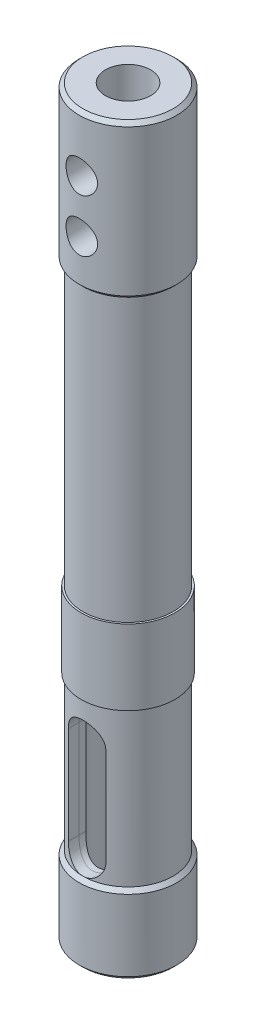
from build123d import *

# Parameters (mm, degrees)
ESQUISSE3_R                = 4.75
ESQUISSE3_R_2              = 4
BOSS_EXTRU_1_DEPTH         = 75
ESQUISSE4_W                = 2.1
ESQUISSE4_H                = 6.5
TROU_TARAUD_M51_AT_2_COUNT = 2
TROU_TARAUD_M51_AT_2_PITCH = 7
ENL_V_MAT_EXTRU_1_DEPTH    = 100.425851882
CHANFREIN1_SIZE            = 0.5


with BuildPart() as part:
    # Esquisse2 → R_volution1 (revolve)
    with BuildSketch(Plane.XY, mode=Mode.PRIVATE) as r_volution1_sk:
        Polygon((-4.75, 0), (-4.75, 75), (-3, 75), (-3, 99), (-6.5, 99), (-6.5, 79), (-6, 78.5), (-6, 41), (-6.25, 41), (-6.25, 31), (-6, 31), (-6, 10.5), (-6.5, 10), (-6.5, 0), align=None)
    revolve(r_volution1_sk.sketch.rotate(Axis((0, 0, 0), (0, 1, 0)), 270), axis=Axis((0, 0, 0), (0, 1, 0)))

    # Esquisse4 → Trou taraud_ M51 (revolve, cut)
    with BuildSketch(Plane(origin=(0, 91.5, 0), x_dir=(0, 1, 0), z_dir=(1, 0, 0))):
        with Locations((1.05, 3.25)):
            Rectangle(ESQUISSE4_W, ESQUISSE4_H)
    trou_taraud_m51 = revolve(axis=Axis((0, 91.5, -6.35), (0, 0, 1)), mode=Mode.SUBTRACT)

    # Trou taraud_ M51 at 2: Trou taraud_ M51 ×2
    with Locations(*[(0, -i * TROU_TARAUD_M51_AT_2_PITCH, 0) for i in range(1, TROU_TARAUD_M51_AT_2_COUNT)]):
        add(trou_taraud_m51, mode=Mode.SUBTRACT)


with BuildPart() as body_2:
    # Esquisse3 → Boss.-Extru.1 (new body)
    with BuildSketch(Plane.XZ):
        with Locations(Location((0, 0, 0), (0, 0, 270))):
            Circle(ESQUISSE3_R)
        with Locations(Location((0, 0, 0), (0, 0, 270))):
            Circle(ESQUISSE3_R_2, mode=Mode.SUBTRACT)
    extrude(amount=-BOSS_EXTRU_1_DEPTH)


with BuildPart() as enl_v_mat_extru_1_tool:
    # Esquisse6 → Enl_v. mat.-Extru.1 (new, through all)
    with BuildSketch(Plane.XY):
        with BuildLine():
            Line((2.5, 26), (2.5, 13))
            ThreePointArc((2.5, 13), (0, 10.5), (-2.5, 13))
            Line((-2.5, 13), (-2.5, 26))
            ThreePointArc((-2.5, 26), (0, 28.5), (2.5, 26))
        make_face()
    extrude(amount=ENL_V_MAT_EXTRU_1_DEPTH)


with BuildPart() as part_1:
    add(part.part)

    # Enl_v. mat.-Extru.1: cut by enl_v_mat_extru_1_tool
    add(enl_v_mat_extru_1_tool.part, mode=Mode.SUBTRACT)

    # Chanfrein1
    chanfrein1_edges = [part_1.edges().sort_by_distance(p)[0] for p in [
        (0, 99, 6.5),
        (0, 0, 6.5),
    ]]
    chamfer(chanfrein1_edges, length=CHANFREIN1_SIZE)


with BuildPart() as body_2_1:
    add(body_2.part)

    # Enl_v. mat.-Extru.1: cut by enl_v_mat_extru_1_tool
    add(enl_v_mat_extru_1_tool.part, mode=Mode.SUBTRACT)


solid = Compound([part_1.part, body_2_1.part])
